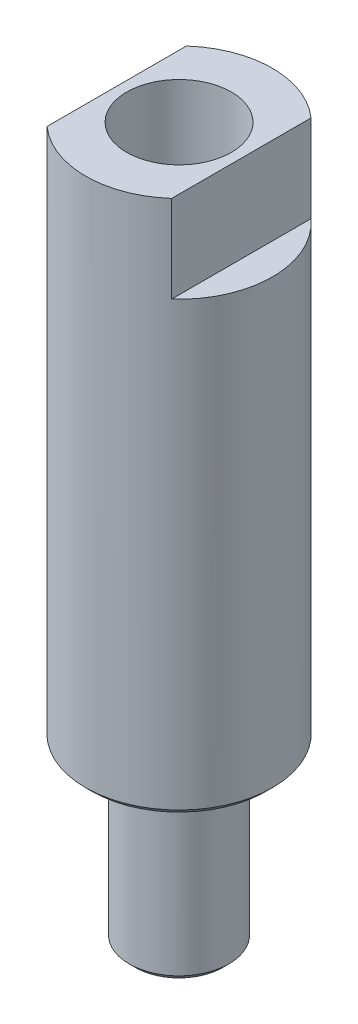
ISO-10303-21;
HEADER;
FILE_DESCRIPTION(('STEP AP214'),'2;1');
FILE_NAME('part.step','',(''),(''),'','','');
FILE_SCHEMA(('AUTOMOTIVE_DESIGN { 1 0 10303 214 1 1 1 1 }'));
ENDSEC;
DATA;
#1=APPLICATION_CONTEXT('core data for automotive mechanical design processes');
#2=APPLICATION_PROTOCOL_DEFINITION('international standard','automotive_design',2000,#1);
#3=PRODUCT_CONTEXT('',#1,'mechanical');
#4=PRODUCT('Part','Part','',(#3));
#5=PRODUCT_RELATED_PRODUCT_CATEGORY('part','',(#4));
#6=PRODUCT_DEFINITION_FORMATION('','',#4);
#7=PRODUCT_DEFINITION_CONTEXT('part definition',#1,'design');
#8=PRODUCT_DEFINITION('design','',#6,#7);
#9=PRODUCT_DEFINITION_SHAPE('','',#8);
#10=(LENGTH_UNIT() NAMED_UNIT(*) SI_UNIT(.MILLI.,.METRE.));
#11=(NAMED_UNIT(*) PLANE_ANGLE_UNIT() SI_UNIT($,.RADIAN.));
#12=(NAMED_UNIT(*) SI_UNIT($,.STERADIAN.) SOLID_ANGLE_UNIT());
#13=UNCERTAINTY_MEASURE_WITH_UNIT(LENGTH_MEASURE(1.E-05),#10,'distance_accuracy_value','');
#14=(GEOMETRIC_REPRESENTATION_CONTEXT(3) GLOBAL_UNCERTAINTY_ASSIGNED_CONTEXT((#13)) GLOBAL_UNIT_ASSIGNED_CONTEXT((#10,
#11,#12)) REPRESENTATION_CONTEXT('',''));
#15=CARTESIAN_POINT('',(0.,0.,0.));
#16=DIRECTION('',(0.,0.,1.));
#17=DIRECTION('',(1.,0.,0.));
#18=AXIS2_PLACEMENT_3D('',#15,#16,#17);
#19=CARTESIAN_POINT('',(0.,43.,0.));
#20=DIRECTION('',(0.,1.,0.));
#21=DIRECTION('',(0.,0.,1.));
#22=AXIS2_PLACEMENT_3D('',#19,#20,#21);
#23=PLANE('',#22);
#24=DIRECTION('',(0.,0.,-1.));
#25=VECTOR('',#24,1.);
#26=CARTESIAN_POINT('',(-5.,43.,0.));
#27=LINE('',#26,#25);
#28=CARTESIAN_POINT('',(-5.,43.,5.59016994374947));
#29=VERTEX_POINT('',#28);
#30=CARTESIAN_POINT('',(-5.,43.,-5.59016994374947));
#31=VERTEX_POINT('',#30);
#32=EDGE_CURVE('E84',#29,#31,#27,.T.);
#33=ORIENTED_EDGE('',*,*,#32,.F.);
#34=CARTESIAN_POINT('',(0.,43.,0.));
#35=DIRECTION('',(0.,1.,0.));
#36=DIRECTION('',(0.,0.,1.));
#37=AXIS2_PLACEMENT_3D('',#34,#35,#36);
#38=CIRCLE('',#37,7.5);
#39=CARTESIAN_POINT('',(5.,43.,5.59016994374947));
#40=VERTEX_POINT('',#39);
#41=EDGE_CURVE('E109',#29,#40,#38,.T.);
#42=ORIENTED_EDGE('',*,*,#41,.T.);
#43=DIRECTION('',(0.,0.,-1.));
#44=VECTOR('',#43,1.);
#45=CARTESIAN_POINT('',(5.,43.,0.));
#46=LINE('',#45,#44);
#47=CARTESIAN_POINT('',(5.,43.,-5.59016994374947));
#48=VERTEX_POINT('',#47);
#49=EDGE_CURVE('E99',#40,#48,#46,.T.);
#50=ORIENTED_EDGE('',*,*,#49,.T.);
#51=EDGE_CURVE('E112',#48,#31,#38,.T.);
#52=ORIENTED_EDGE('',*,*,#51,.T.);
#53=EDGE_LOOP('',(#33,#42,#50,#52));
#54=FACE_BOUND('',#53,.T.);
#55=CARTESIAN_POINT('',(0.,43.,0.));
#56=DIRECTION('',(0.,-1.,0.));
#57=DIRECTION('',(0.,0.,-1.));
#58=AXIS2_PLACEMENT_3D('',#55,#56,#57);
#59=CIRCLE('',#58,4.2);
#60=CARTESIAN_POINT('',(0.,43.,-4.2));
#61=VERTEX_POINT('',#60);
#62=EDGE_CURVE('E85',#61,#61,#59,.T.);
#63=ORIENTED_EDGE('',*,*,#62,.T.);
#64=EDGE_LOOP('',(#63));
#65=FACE_BOUND('',#64,.T.);
#66=ADVANCED_FACE('F30',(#54,#65),#23,.T.);
#67=CARTESIAN_POINT('',(0.,43.,0.));
#68=DIRECTION('',(0.,-1.,0.));
#69=DIRECTION('',(0.,0.,-1.));
#70=AXIS2_PLACEMENT_3D('',#67,#68,#69);
#71=CYLINDRICAL_SURFACE('',#70,7.5);
#72=CARTESIAN_POINT('',(0.,0.5,0.));
#73=DIRECTION('',(0.,1.,0.));
#74=DIRECTION('',(0.,0.,1.));
#75=AXIS2_PLACEMENT_3D('',#72,#73,#74);
#76=CIRCLE('',#75,7.5);
#77=CARTESIAN_POINT('',(0.,0.5,7.5));
#78=VERTEX_POINT('',#77);
#79=EDGE_CURVE('E38',#78,#78,#76,.T.);
#80=ORIENTED_EDGE('',*,*,#79,.T.);
#81=EDGE_LOOP('',(#80));
#82=FACE_BOUND('',#81,.T.);
#83=ORIENTED_EDGE('',*,*,#41,.F.);
#84=DIRECTION('',(0.,1.,0.));
#85=VECTOR('',#84,1.);
#86=CARTESIAN_POINT('',(-5.,36.,5.59016994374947));
#87=LINE('',#86,#85);
#88=CARTESIAN_POINT('',(-5.,36.,5.59016994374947));
#89=VERTEX_POINT('',#88);
#90=EDGE_CURVE('E45',#89,#29,#87,.T.);
#91=ORIENTED_EDGE('',*,*,#90,.F.);
#92=CARTESIAN_POINT('',(0.,36.,0.));
#93=DIRECTION('',(0.,1.,0.));
#94=DIRECTION('',(0.,0.,1.));
#95=AXIS2_PLACEMENT_3D('',#92,#93,#94);
#96=CIRCLE('',#95,7.5);
#97=CARTESIAN_POINT('',(-5.,36.,-5.59016994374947));
#98=VERTEX_POINT('',#97);
#99=EDGE_CURVE('E87',#98,#89,#96,.T.);
#100=ORIENTED_EDGE('',*,*,#99,.F.);
#101=DIRECTION('',(0.,1.,0.));
#102=VECTOR('',#101,1.);
#103=CARTESIAN_POINT('',(-5.,36.,-5.59016994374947));
#104=LINE('',#103,#102);
#105=EDGE_CURVE('E96',#98,#31,#104,.T.);
#106=ORIENTED_EDGE('',*,*,#105,.T.);
#107=ORIENTED_EDGE('',*,*,#51,.F.);
#108=DIRECTION('',(0.,1.,0.));
#109=VECTOR('',#108,1.);
#110=CARTESIAN_POINT('',(5.,36.,-5.59016994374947));
#111=LINE('',#110,#109);
#112=CARTESIAN_POINT('',(5.,36.,-5.59016994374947));
#113=VERTEX_POINT('',#112);
#114=EDGE_CURVE('E53',#113,#48,#111,.T.);
#115=ORIENTED_EDGE('',*,*,#114,.F.);
#116=CARTESIAN_POINT('',(0.,36.,0.));
#117=DIRECTION('',(0.,1.,0.));
#118=DIRECTION('',(0.,0.,1.));
#119=AXIS2_PLACEMENT_3D('',#116,#117,#118);
#120=CIRCLE('',#119,7.5);
#121=CARTESIAN_POINT('',(5.,36.,5.59016994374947));
#122=VERTEX_POINT('',#121);
#123=EDGE_CURVE('E104',#122,#113,#120,.T.);
#124=ORIENTED_EDGE('',*,*,#123,.F.);
#125=DIRECTION('',(0.,1.,0.));
#126=VECTOR('',#125,1.);
#127=CARTESIAN_POINT('',(5.,36.,5.59016994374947));
#128=LINE('',#127,#126);
#129=EDGE_CURVE('E107',#122,#40,#128,.T.);
#130=ORIENTED_EDGE('',*,*,#129,.T.);
#131=EDGE_LOOP('',(#83,#91,#100,#106,#107,#115,#124,#130));
#132=FACE_BOUND('',#131,.T.);
#133=ADVANCED_FACE('F32',(#82,#132),#71,.T.);
#134=CARTESIAN_POINT('',(0.,0.,0.));
#135=DIRECTION('',(0.,1.,0.));
#136=DIRECTION('',(0.,0.,1.));
#137=AXIS2_PLACEMENT_3D('',#134,#135,#136);
#138=PLANE('',#137);
#139=CARTESIAN_POINT('',(0.,0.,0.));
#140=DIRECTION('',(0.,1.,0.));
#141=DIRECTION('',(0.,0.,1.));
#142=AXIS2_PLACEMENT_3D('',#139,#140,#141);
#143=CIRCLE('',#142,6.99999999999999);
#144=CARTESIAN_POINT('',(0.,0.,6.99999999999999));
#145=VERTEX_POINT('',#144);
#146=EDGE_CURVE('E11',#145,#145,#143,.F.);
#147=ORIENTED_EDGE('',*,*,#146,.T.);
#148=EDGE_LOOP('',(#147));
#149=FACE_BOUND('',#148,.T.);
#150=CARTESIAN_POINT('',(0.,0.,0.));
#151=DIRECTION('',(0.,1.,0.));
#152=DIRECTION('',(0.,0.,1.));
#153=AXIS2_PLACEMENT_3D('',#150,#151,#152);
#154=CIRCLE('',#153,4.);
#155=CARTESIAN_POINT('',(0.,0.,4.));
#156=VERTEX_POINT('',#155);
#157=EDGE_CURVE('E115',#156,#156,#154,.F.);
#158=ORIENTED_EDGE('',*,*,#157,.F.);
#159=EDGE_LOOP('',(#158));
#160=FACE_BOUND('',#159,.T.);
#161=ADVANCED_FACE('F144',(#149,#160),#138,.F.);
#162=CARTESIAN_POINT('',(0.,-14.,0.));
#163=DIRECTION('',(0.,1.,0.));
#164=DIRECTION('',(0.,0.,1.));
#165=AXIS2_PLACEMENT_3D('',#162,#163,#164);
#166=CYLINDRICAL_SURFACE('',#165,4.);
#167=CARTESIAN_POINT('',(0.,-13.5,0.));
#168=DIRECTION('',(0.,-1.,0.));
#169=DIRECTION('',(0.,0.,-1.));
#170=AXIS2_PLACEMENT_3D('',#167,#168,#169);
#171=CIRCLE('',#170,4.);
#172=CARTESIAN_POINT('',(0.,-13.5,-4.));
#173=VERTEX_POINT('',#172);
#174=EDGE_CURVE('E121',#173,#173,#171,.F.);
#175=ORIENTED_EDGE('',*,*,#174,.T.);
#176=EDGE_LOOP('',(#175));
#177=FACE_BOUND('',#176,.T.);
#178=ORIENTED_EDGE('',*,*,#157,.T.);
#179=EDGE_LOOP('',(#178));
#180=FACE_BOUND('',#179,.T.);
#181=ADVANCED_FACE('F149',(#177,#180),#166,.T.);
#182=CARTESIAN_POINT('',(0.,-14.,0.));
#183=DIRECTION('',(0.,-1.,0.));
#184=DIRECTION('',(0.,0.,-1.));
#185=AXIS2_PLACEMENT_3D('',#182,#183,#184);
#186=PLANE('',#185);
#187=CARTESIAN_POINT('',(0.,-14.,0.));
#188=DIRECTION('',(0.,-1.,0.));
#189=DIRECTION('',(0.,0.,-1.));
#190=AXIS2_PLACEMENT_3D('',#187,#188,#189);
#191=CIRCLE('',#190,3.49999999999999);
#192=CARTESIAN_POINT('',(0.,-14.,-3.49999999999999));
#193=VERTEX_POINT('',#192);
#194=EDGE_CURVE('E118',#193,#193,#191,.T.);
#195=ORIENTED_EDGE('',*,*,#194,.T.);
#196=EDGE_LOOP('',(#195));
#197=FACE_BOUND('',#196,.T.);
#198=ADVANCED_FACE('F153',(#197),#186,.T.);
#199=CARTESIAN_POINT('',(5.,36.,0.));
#200=DIRECTION('',(1.,0.,0.));
#201=DIRECTION('',(0.,0.,-1.));
#202=AXIS2_PLACEMENT_3D('',#199,#200,#201);
#203=PLANE('',#202);
#204=ORIENTED_EDGE('',*,*,#49,.F.);
#205=ORIENTED_EDGE('',*,*,#129,.F.);
#206=DIRECTION('',(0.,0.,-1.));
#207=VECTOR('',#206,1.);
#208=CARTESIAN_POINT('',(5.,36.,0.));
#209=LINE('',#208,#207);
#210=EDGE_CURVE('E102',#122,#113,#209,.T.);
#211=ORIENTED_EDGE('',*,*,#210,.T.);
#212=ORIENTED_EDGE('',*,*,#114,.T.);
#213=EDGE_LOOP('',(#204,#205,#211,#212));
#214=FACE_BOUND('',#213,.T.);
#215=ADVANCED_FACE('F157',(#214),#203,.T.);
#216=CARTESIAN_POINT('',(-16.6414213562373,36.,0.));
#217=DIRECTION('',(0.,1.,0.));
#218=DIRECTION('',(0.,0.,1.));
#219=AXIS2_PLACEMENT_3D('',#216,#217,#218);
#220=PLANE('',#219);
#221=ORIENTED_EDGE('',*,*,#210,.F.);
#222=ORIENTED_EDGE('',*,*,#123,.T.);
#223=EDGE_LOOP('',(#221,#222));
#224=FACE_BOUND('',#223,.T.);
#225=ADVANCED_FACE('F161',(#224),#220,.T.);
#226=CARTESIAN_POINT('',(-5.,36.,0.));
#227=DIRECTION('',(1.,0.,0.));
#228=DIRECTION('',(0.,0.,-1.));
#229=AXIS2_PLACEMENT_3D('',#226,#227,#228);
#230=PLANE('',#229);
#231=ORIENTED_EDGE('',*,*,#32,.T.);
#232=ORIENTED_EDGE('',*,*,#105,.F.);
#233=DIRECTION('',(0.,0.,-1.));
#234=VECTOR('',#233,1.);
#235=CARTESIAN_POINT('',(-5.,36.,0.));
#236=LINE('',#235,#234);
#237=EDGE_CURVE('E93',#89,#98,#236,.T.);
#238=ORIENTED_EDGE('',*,*,#237,.F.);
#239=ORIENTED_EDGE('',*,*,#90,.T.);
#240=EDGE_LOOP('',(#231,#232,#238,#239));
#241=FACE_BOUND('',#240,.T.);
#242=ADVANCED_FACE('F164',(#241),#230,.F.);
#243=CARTESIAN_POINT('',(-16.6414213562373,36.,0.));
#244=DIRECTION('',(0.,1.,0.));
#245=DIRECTION('',(0.,0.,1.));
#246=AXIS2_PLACEMENT_3D('',#243,#244,#245);
#247=PLANE('',#246);
#248=ORIENTED_EDGE('',*,*,#99,.T.);
#249=ORIENTED_EDGE('',*,*,#237,.T.);
#250=EDGE_LOOP('',(#248,#249));
#251=FACE_BOUND('',#250,.T.);
#252=ADVANCED_FACE('F135',(#251),#247,.T.);
#253=CARTESIAN_POINT('',(0.,-14.,0.));
#254=DIRECTION('',(0.,1.,0.));
#255=DIRECTION('',(0.,0.,1.));
#256=AXIS2_PLACEMENT_3D('',#253,#254,#255);
#257=CONICAL_SURFACE('',#256,3.49999999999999,0.785398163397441);
#258=ORIENTED_EDGE('',*,*,#174,.F.);
#259=EDGE_LOOP('',(#258));
#260=FACE_BOUND('',#259,.T.);
#261=ORIENTED_EDGE('',*,*,#194,.F.);
#262=EDGE_LOOP('',(#261));
#263=FACE_BOUND('',#262,.T.);
#264=ADVANCED_FACE('F129',(#260,#263),#257,.T.);
#265=CARTESIAN_POINT('',(0.,0.5,0.));
#266=DIRECTION('',(0.,1.,0.));
#267=DIRECTION('',(0.,0.,1.));
#268=AXIS2_PLACEMENT_3D('',#265,#266,#267);
#269=CONICAL_SURFACE('',#268,7.5,0.785398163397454);
#270=ORIENTED_EDGE('',*,*,#146,.F.);
#271=EDGE_LOOP('',(#270));
#272=FACE_BOUND('',#271,.T.);
#273=ORIENTED_EDGE('',*,*,#79,.F.);
#274=EDGE_LOOP('',(#273));
#275=FACE_BOUND('',#274,.T.);
#276=ADVANCED_FACE('F78',(#272,#275),#269,.T.);
#277=CARTESIAN_POINT('',(0.,25.,0.));
#278=DIRECTION('',(0.,1.,0.));
#279=DIRECTION('',(0.,0.,1.));
#280=AXIS2_PLACEMENT_3D('',#277,#278,#279);
#281=CONICAL_SURFACE('',#280,4.2,1.02974425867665);
#282=CARTESIAN_POINT('',(0.,22.4763854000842,0.));
#283=VERTEX_POINT('',#282);
#284=VERTEX_LOOP('',#283);
#285=FACE_BOUND('',#284,.T.);
#286=CARTESIAN_POINT('',(0.,25.,0.));
#287=DIRECTION('',(0.,-1.,0.));
#288=DIRECTION('',(0.,0.,-1.));
#289=AXIS2_PLACEMENT_3D('',#286,#287,#288);
#290=CIRCLE('',#289,4.2);
#291=CARTESIAN_POINT('',(0.,25.,-4.2));
#292=VERTEX_POINT('',#291);
#293=EDGE_CURVE('E82',#292,#292,#290,.T.);
#294=ORIENTED_EDGE('',*,*,#293,.F.);
#295=EDGE_LOOP('',(#294));
#296=FACE_BOUND('',#295,.T.);
#297=ADVANCED_FACE('F74',(#285,#296),#281,.F.);
#298=CARTESIAN_POINT('',(0.,0.,0.));
#299=DIRECTION('',(0.,-1.,0.));
#300=DIRECTION('',(0.,0.,-1.));
#301=AXIS2_PLACEMENT_3D('',#298,#299,#300);
#302=CYLINDRICAL_SURFACE('',#301,4.2);
#303=ORIENTED_EDGE('',*,*,#293,.T.);
#304=EDGE_LOOP('',(#303));
#305=FACE_BOUND('',#304,.T.);
#306=ORIENTED_EDGE('',*,*,#62,.F.);
#307=EDGE_LOOP('',(#306));
#308=FACE_BOUND('',#307,.T.);
#309=ADVANCED_FACE('F77',(#305,#308),#302,.F.);
#310=CLOSED_SHELL('',(#66,#133,#161,#181,#198,#215,#225,#242,#252,#264,#276,#297,#309));
#311=MANIFOLD_SOLID_BREP('B2',#310);
#312=ADVANCED_BREP_SHAPE_REPRESENTATION('',(#18,#311),#14);
#313=SHAPE_DEFINITION_REPRESENTATION(#9,#312);
ENDSEC;
END-ISO-10303-21;
